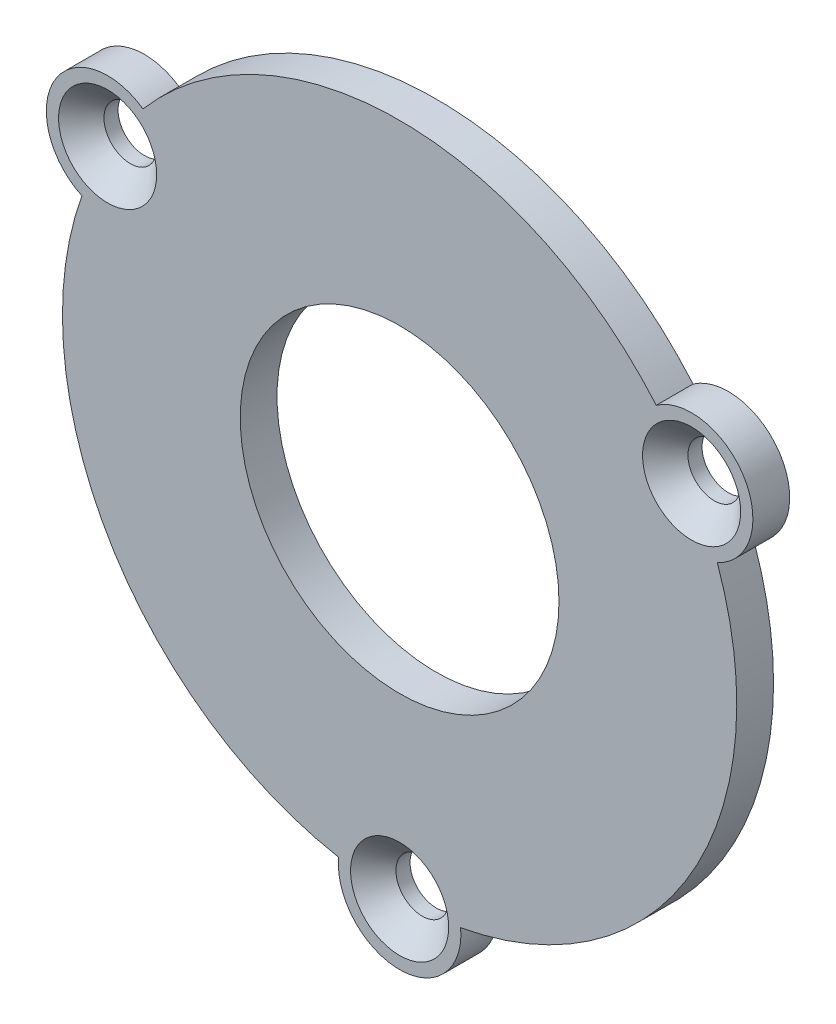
ISO-10303-21;
HEADER;
FILE_DESCRIPTION(('STEP AP214'),'2;1');
FILE_NAME('part.step','',(''),(''),'','','');
FILE_SCHEMA(('AUTOMOTIVE_DESIGN { 1 0 10303 214 1 1 1 1 }'));
ENDSEC;
DATA;
#1=APPLICATION_CONTEXT('core data for automotive mechanical design processes');
#2=APPLICATION_PROTOCOL_DEFINITION('international standard','automotive_design',2000,#1);
#3=PRODUCT_CONTEXT('',#1,'mechanical');
#4=PRODUCT('Part','Part','',(#3));
#5=PRODUCT_RELATED_PRODUCT_CATEGORY('part','',(#4));
#6=PRODUCT_DEFINITION_FORMATION('','',#4);
#7=PRODUCT_DEFINITION_CONTEXT('part definition',#1,'design');
#8=PRODUCT_DEFINITION('design','',#6,#7);
#9=PRODUCT_DEFINITION_SHAPE('','',#8);
#10=(LENGTH_UNIT() NAMED_UNIT(*) SI_UNIT(.MILLI.,.METRE.));
#11=(NAMED_UNIT(*) PLANE_ANGLE_UNIT() SI_UNIT($,.RADIAN.));
#12=(NAMED_UNIT(*) SI_UNIT($,.STERADIAN.) SOLID_ANGLE_UNIT());
#13=UNCERTAINTY_MEASURE_WITH_UNIT(LENGTH_MEASURE(1.E-05),#10,'distance_accuracy_value','');
#14=(GEOMETRIC_REPRESENTATION_CONTEXT(3) GLOBAL_UNCERTAINTY_ASSIGNED_CONTEXT((#13)) GLOBAL_UNIT_ASSIGNED_CONTEXT((#10,
#11,#12)) REPRESENTATION_CONTEXT('',''));
#15=CARTESIAN_POINT('',(0.,0.,0.));
#16=DIRECTION('',(0.,0.,1.));
#17=DIRECTION('',(1.,0.,0.));
#18=AXIS2_PLACEMENT_3D('',#15,#16,#17);
#19=CARTESIAN_POINT('',(0.,0.,3.));
#20=DIRECTION('',(0.,0.,-1.));
#21=DIRECTION('',(-1.,0.,0.));
#22=AXIS2_PLACEMENT_3D('',#19,#20,#21);
#23=CYLINDRICAL_SURFACE('',#22,27.5);
#24=DIRECTION('',(0.,0.,-1.));
#25=VECTOR('',#24,1.);
#26=CARTESIAN_POINT('',(25.9116986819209,9.21053046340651,1.5));
#27=LINE('',#26,#25);
#28=CARTESIAN_POINT('',(25.9116986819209,9.21053046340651,3.));
#29=VERTEX_POINT('',#28);
#30=CARTESIAN_POINT('',(25.9116986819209,9.21053046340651,0.));
#31=VERTEX_POINT('',#30);
#32=EDGE_CURVE('E88',#29,#31,#27,.T.);
#33=ORIENTED_EDGE('',*,*,#32,.F.);
#34=CARTESIAN_POINT('',(0.,0.,3.));
#35=DIRECTION('',(0.,0.,1.));
#36=DIRECTION('',(1.,0.,0.));
#37=AXIS2_PLACEMENT_3D('',#34,#35,#36);
#38=CIRCLE('',#37,27.5);
#39=CARTESIAN_POINT('',(4.97929597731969,-27.0454545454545,3.));
#40=VERTEX_POINT('',#39);
#41=EDGE_CURVE('E113',#40,#29,#38,.T.);
#42=ORIENTED_EDGE('',*,*,#41,.F.);
#43=DIRECTION('',(0.,0.,-1.));
#44=VECTOR('',#43,1.);
#45=CARTESIAN_POINT('',(4.97929597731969,-27.0454545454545,1.5));
#46=LINE('',#45,#44);
#47=CARTESIAN_POINT('',(4.97929597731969,-27.0454545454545,0.));
#48=VERTEX_POINT('',#47);
#49=EDGE_CURVE('E39',#48,#40,#46,.F.);
#50=ORIENTED_EDGE('',*,*,#49,.F.);
#51=CARTESIAN_POINT('',(0.,0.,0.));
#52=DIRECTION('',(0.,0.,1.));
#53=DIRECTION('',(1.,0.,0.));
#54=AXIS2_PLACEMENT_3D('',#51,#52,#53);
#55=CIRCLE('',#54,27.5);
#56=EDGE_CURVE('E107',#48,#31,#55,.T.);
#57=ORIENTED_EDGE('',*,*,#56,.T.);
#58=EDGE_LOOP('',(#33,#42,#50,#57));
#59=FACE_BOUND('',#58,.T.);
#60=ADVANCED_FACE('F32',(#59),#23,.T.);
#61=DIRECTION('',(0.,0.,-1.));
#62=VECTOR('',#61,1.);
#63=CARTESIAN_POINT('',(20.9324027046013,17.8349240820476,1.5));
#64=LINE('',#63,#62);
#65=CARTESIAN_POINT('',(20.9324027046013,17.8349240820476,0.));
#66=VERTEX_POINT('',#65);
#67=CARTESIAN_POINT('',(20.9324027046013,17.8349240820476,3.));
#68=VERTEX_POINT('',#67);
#69=EDGE_CURVE('E85',#66,#68,#64,.F.);
#70=ORIENTED_EDGE('',*,*,#69,.F.);
#71=CARTESIAN_POINT('',(-20.932402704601,17.8349240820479,0.));
#72=VERTEX_POINT('',#71);
#73=EDGE_CURVE('E98',#66,#72,#55,.T.);
#74=ORIENTED_EDGE('',*,*,#73,.T.);
#75=DIRECTION('',(0.,0.,-1.));
#76=VECTOR('',#75,1.);
#77=CARTESIAN_POINT('',(-20.932402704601,17.8349240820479,1.5));
#78=LINE('',#77,#76);
#79=CARTESIAN_POINT('',(-20.932402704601,17.8349240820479,3.));
#80=VERTEX_POINT('',#79);
#81=EDGE_CURVE('E195',#80,#72,#78,.T.);
#82=ORIENTED_EDGE('',*,*,#81,.F.);
#83=EDGE_CURVE('E100',#68,#80,#38,.T.);
#84=ORIENTED_EDGE('',*,*,#83,.F.);
#85=EDGE_LOOP('',(#70,#74,#82,#84));
#86=FACE_BOUND('',#85,.T.);
#87=ADVANCED_FACE('F96',(#86),#23,.T.);
#88=DIRECTION('',(0.,0.,-1.));
#89=VECTOR('',#88,1.);
#90=CARTESIAN_POINT('',(-25.9116986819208,9.21053046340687,1.5));
#91=LINE('',#90,#89);
#92=CARTESIAN_POINT('',(-25.9116986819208,9.21053046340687,0.));
#93=VERTEX_POINT('',#92);
#94=CARTESIAN_POINT('',(-25.9116986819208,9.21053046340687,3.));
#95=VERTEX_POINT('',#94);
#96=EDGE_CURVE('E133',#93,#95,#91,.F.);
#97=ORIENTED_EDGE('',*,*,#96,.F.);
#98=CARTESIAN_POINT('',(-4.97929597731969,-27.0454545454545,0.));
#99=VERTEX_POINT('',#98);
#100=EDGE_CURVE('E108',#93,#99,#55,.T.);
#101=ORIENTED_EDGE('',*,*,#100,.T.);
#102=DIRECTION('',(0.,0.,-1.));
#103=VECTOR('',#102,1.);
#104=CARTESIAN_POINT('',(-4.97929597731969,-27.0454545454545,1.5));
#105=LINE('',#104,#103);
#106=CARTESIAN_POINT('',(-4.97929597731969,-27.0454545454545,3.));
#107=VERTEX_POINT('',#106);
#108=EDGE_CURVE('E11',#107,#99,#105,.T.);
#109=ORIENTED_EDGE('',*,*,#108,.F.);
#110=EDGE_CURVE('E110',#95,#107,#38,.T.);
#111=ORIENTED_EDGE('',*,*,#110,.F.);
#112=EDGE_LOOP('',(#97,#101,#109,#111));
#113=FACE_BOUND('',#112,.T.);
#114=ADVANCED_FACE('F132',(#113),#23,.T.);
#115=CARTESIAN_POINT('',(0.,0.,3.));
#116=DIRECTION('',(0.,0.,1.));
#117=DIRECTION('',(1.,0.,0.));
#118=AXIS2_PLACEMENT_3D('',#115,#116,#117);
#119=PLANE('',#118);
#120=CARTESIAN_POINT('',(23.8156986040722,13.7499999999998,3.));
#121=DIRECTION('',(0.,0.,1.));
#122=DIRECTION('',(1.,0.,0.));
#123=AXIS2_PLACEMENT_3D('',#120,#121,#122);
#124=CIRCLE('',#123,4.);
#125=CARTESIAN_POINT('',(27.8156986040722,13.7499999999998,3.));
#126=VERTEX_POINT('',#125);
#127=EDGE_CURVE('E173',#126,#126,#124,.T.);
#128=ORIENTED_EDGE('',*,*,#127,.F.);
#129=EDGE_LOOP('',(#128));
#130=FACE_BOUND('',#129,.T.);
#131=CARTESIAN_POINT('',(-23.815698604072,13.7500000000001,3.));
#132=DIRECTION('',(0.,0.,1.));
#133=DIRECTION('',(1.,0.,0.));
#134=AXIS2_PLACEMENT_3D('',#131,#132,#133);
#135=CIRCLE('',#134,4.);
#136=CARTESIAN_POINT('',(-19.815698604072,13.7500000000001,3.));
#137=VERTEX_POINT('',#136);
#138=EDGE_CURVE('E176',#137,#137,#135,.T.);
#139=ORIENTED_EDGE('',*,*,#138,.F.);
#140=EDGE_LOOP('',(#139));
#141=FACE_BOUND('',#140,.T.);
#142=ORIENTED_EDGE('',*,*,#41,.T.);
#143=CARTESIAN_POINT('',(23.8156986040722,13.7499999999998,3.));
#144=DIRECTION('',(0.,0.,1.));
#145=DIRECTION('',(1.,0.,0.));
#146=AXIS2_PLACEMENT_3D('',#143,#144,#145);
#147=CIRCLE('',#146,5.);
#148=EDGE_CURVE('E46',#29,#68,#147,.T.);
#149=ORIENTED_EDGE('',*,*,#148,.T.);
#150=ORIENTED_EDGE('',*,*,#83,.T.);
#151=CARTESIAN_POINT('',(-23.815698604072,13.7500000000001,3.));
#152=DIRECTION('',(0.,0.,1.));
#153=DIRECTION('',(1.,0.,0.));
#154=AXIS2_PLACEMENT_3D('',#151,#152,#153);
#155=CIRCLE('',#154,5.);
#156=EDGE_CURVE('E52',#80,#95,#155,.T.);
#157=ORIENTED_EDGE('',*,*,#156,.T.);
#158=ORIENTED_EDGE('',*,*,#110,.T.);
#159=CARTESIAN_POINT('',(0.,-27.5,3.));
#160=DIRECTION('',(0.,0.,1.));
#161=DIRECTION('',(1.,0.,0.));
#162=AXIS2_PLACEMENT_3D('',#159,#160,#161);
#163=CIRCLE('',#162,5.);
#164=EDGE_CURVE('E123',#107,#40,#163,.T.);
#165=ORIENTED_EDGE('',*,*,#164,.T.);
#166=EDGE_LOOP('',(#142,#149,#150,#157,#158,#165));
#167=FACE_BOUND('',#166,.T.);
#168=CARTESIAN_POINT('',(0.,-27.5,3.));
#169=DIRECTION('',(0.,0.,1.));
#170=DIRECTION('',(1.,0.,0.));
#171=AXIS2_PLACEMENT_3D('',#168,#169,#170);
#172=CIRCLE('',#171,4.);
#173=CARTESIAN_POINT('',(4.,-27.5,3.));
#174=VERTEX_POINT('',#173);
#175=EDGE_CURVE('E197',#174,#174,#172,.T.);
#176=ORIENTED_EDGE('',*,*,#175,.F.);
#177=EDGE_LOOP('',(#176));
#178=FACE_BOUND('',#177,.T.);
#179=CARTESIAN_POINT('',(0.,0.,3.));
#180=DIRECTION('',(0.,0.,1.));
#181=DIRECTION('',(1.,0.,0.));
#182=AXIS2_PLACEMENT_3D('',#179,#180,#181);
#183=CIRCLE('',#182,13.);
#184=CARTESIAN_POINT('',(13.,0.,3.));
#185=VERTEX_POINT('',#184);
#186=EDGE_CURVE('E111',#185,#185,#183,.T.);
#187=ORIENTED_EDGE('',*,*,#186,.F.);
#188=EDGE_LOOP('',(#187));
#189=FACE_BOUND('',#188,.T.);
#190=ADVANCED_FACE('F121',(#130,#141,#167,#178,#189),#119,.T.);
#191=CARTESIAN_POINT('',(0.,0.,0.));
#192=DIRECTION('',(0.,0.,1.));
#193=DIRECTION('',(1.,0.,0.));
#194=AXIS2_PLACEMENT_3D('',#191,#192,#193);
#195=PLANE('',#194);
#196=CARTESIAN_POINT('',(23.8156986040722,13.7499999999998,0.));
#197=DIRECTION('',(0.,0.,1.));
#198=DIRECTION('',(1.,0.,0.));
#199=AXIS2_PLACEMENT_3D('',#196,#197,#198);
#200=CIRCLE('',#199,2.15);
#201=CARTESIAN_POINT('',(25.9656986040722,13.7499999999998,0.));
#202=VERTEX_POINT('',#201);
#203=EDGE_CURVE('E179',#202,#202,#200,.T.);
#204=ORIENTED_EDGE('',*,*,#203,.T.);
#205=EDGE_LOOP('',(#204));
#206=FACE_BOUND('',#205,.T.);
#207=CARTESIAN_POINT('',(-23.815698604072,13.7500000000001,0.));
#208=DIRECTION('',(0.,0.,1.));
#209=DIRECTION('',(1.,0.,0.));
#210=AXIS2_PLACEMENT_3D('',#207,#208,#209);
#211=CIRCLE('',#210,2.15);
#212=CARTESIAN_POINT('',(-21.665698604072,13.7500000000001,0.));
#213=VERTEX_POINT('',#212);
#214=EDGE_CURVE('E93',#213,#213,#211,.T.);
#215=ORIENTED_EDGE('',*,*,#214,.T.);
#216=EDGE_LOOP('',(#215));
#217=FACE_BOUND('',#216,.T.);
#218=ORIENTED_EDGE('',*,*,#73,.F.);
#219=CARTESIAN_POINT('',(23.8156986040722,13.7499999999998,0.));
#220=DIRECTION('',(0.,0.,1.));
#221=DIRECTION('',(-0.499999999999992,0.866025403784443,0.));
#222=AXIS2_PLACEMENT_3D('',#219,#220,#221);
#223=CIRCLE('',#222,5.);
#224=EDGE_CURVE('E82',#31,#66,#223,.T.);
#225=ORIENTED_EDGE('',*,*,#224,.F.);
#226=ORIENTED_EDGE('',*,*,#56,.F.);
#227=CARTESIAN_POINT('',(0.,-27.5,0.));
#228=DIRECTION('',(0.,0.,1.));
#229=DIRECTION('',(1.,0.,0.));
#230=AXIS2_PLACEMENT_3D('',#227,#228,#229);
#231=CIRCLE('',#230,5.);
#232=EDGE_CURVE('E130',#99,#48,#231,.T.);
#233=ORIENTED_EDGE('',*,*,#232,.F.);
#234=ORIENTED_EDGE('',*,*,#100,.F.);
#235=CARTESIAN_POINT('',(-23.815698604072,13.7500000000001,0.));
#236=DIRECTION('',(0.,0.,1.));
#237=DIRECTION('',(-0.500000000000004,-0.866025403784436,0.));
#238=AXIS2_PLACEMENT_3D('',#235,#236,#237);
#239=CIRCLE('',#238,5.);
#240=EDGE_CURVE('E106',#72,#93,#239,.T.);
#241=ORIENTED_EDGE('',*,*,#240,.F.);
#242=EDGE_LOOP('',(#218,#225,#226,#233,#234,#241));
#243=FACE_BOUND('',#242,.T.);
#244=CARTESIAN_POINT('',(0.,-27.5,0.));
#245=DIRECTION('',(0.,0.,1.));
#246=DIRECTION('',(1.,0.,0.));
#247=AXIS2_PLACEMENT_3D('',#244,#245,#246);
#248=CIRCLE('',#247,2.15);
#249=CARTESIAN_POINT('',(2.15,-27.5,0.));
#250=VERTEX_POINT('',#249);
#251=EDGE_CURVE('E134',#250,#250,#248,.T.);
#252=ORIENTED_EDGE('',*,*,#251,.T.);
#253=EDGE_LOOP('',(#252));
#254=FACE_BOUND('',#253,.T.);
#255=CARTESIAN_POINT('',(0.,0.,0.));
#256=DIRECTION('',(0.,0.,1.));
#257=DIRECTION('',(1.,0.,0.));
#258=AXIS2_PLACEMENT_3D('',#255,#256,#257);
#259=CIRCLE('',#258,13.);
#260=CARTESIAN_POINT('',(13.,0.,0.));
#261=VERTEX_POINT('',#260);
#262=EDGE_CURVE('E129',#261,#261,#259,.T.);
#263=ORIENTED_EDGE('',*,*,#262,.T.);
#264=EDGE_LOOP('',(#263));
#265=FACE_BOUND('',#264,.T.);
#266=ADVANCED_FACE('F103',(#206,#217,#243,#254,#265),#195,.F.);
#267=CARTESIAN_POINT('',(0.,0.,3.));
#268=DIRECTION('',(0.,0.,-1.));
#269=DIRECTION('',(-1.,0.,0.));
#270=AXIS2_PLACEMENT_3D('',#267,#268,#269);
#271=CYLINDRICAL_SURFACE('',#270,13.);
#272=ORIENTED_EDGE('',*,*,#186,.T.);
#273=EDGE_LOOP('',(#272));
#274=FACE_BOUND('',#273,.T.);
#275=ORIENTED_EDGE('',*,*,#262,.F.);
#276=EDGE_LOOP('',(#275));
#277=FACE_BOUND('',#276,.T.);
#278=ADVANCED_FACE('F146',(#274,#277),#271,.F.);
#279=CARTESIAN_POINT('',(0.,-27.5,17.142135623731));
#280=DIRECTION('',(0.,0.,-1.));
#281=DIRECTION('',(-1.,0.,0.));
#282=AXIS2_PLACEMENT_3D('',#279,#280,#281);
#283=CYLINDRICAL_SURFACE('',#282,5.);
#284=ORIENTED_EDGE('',*,*,#164,.F.);
#285=ORIENTED_EDGE('',*,*,#108,.T.);
#286=ORIENTED_EDGE('',*,*,#232,.T.);
#287=ORIENTED_EDGE('',*,*,#49,.T.);
#288=EDGE_LOOP('',(#284,#285,#286,#287));
#289=FACE_BOUND('',#288,.T.);
#290=ADVANCED_FACE('F127',(#289),#283,.T.);
#291=CARTESIAN_POINT('',(0.,-27.5,3.));
#292=DIRECTION('',(0.,0.,1.));
#293=DIRECTION('',(1.,0.,0.));
#294=AXIS2_PLACEMENT_3D('',#291,#292,#293);
#295=CYLINDRICAL_SURFACE('',#294,2.14999999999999);
#296=ORIENTED_EDGE('',*,*,#251,.F.);
#297=EDGE_LOOP('',(#296));
#298=FACE_BOUND('',#297,.T.);
#299=CARTESIAN_POINT('',(0.,-27.5,1.14999999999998));
#300=DIRECTION('',(0.,0.,1.));
#301=DIRECTION('',(1.,0.,0.));
#302=AXIS2_PLACEMENT_3D('',#299,#300,#301);
#303=CIRCLE('',#302,2.14999999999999);
#304=CARTESIAN_POINT('',(2.14999999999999,-27.5,1.14999999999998));
#305=VERTEX_POINT('',#304);
#306=EDGE_CURVE('E137',#305,#305,#303,.T.);
#307=ORIENTED_EDGE('',*,*,#306,.T.);
#308=EDGE_LOOP('',(#307));
#309=FACE_BOUND('',#308,.T.);
#310=ADVANCED_FACE('F154',(#298,#309),#295,.F.);
#311=CARTESIAN_POINT('',(0.,-27.5,3.));
#312=DIRECTION('',(0.,0.,1.));
#313=DIRECTION('',(1.,0.,0.));
#314=AXIS2_PLACEMENT_3D('',#311,#312,#313);
#315=CONICAL_SURFACE('',#314,4.,0.785398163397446);
#316=ORIENTED_EDGE('',*,*,#306,.F.);
#317=EDGE_LOOP('',(#316));
#318=FACE_BOUND('',#317,.T.);
#319=ORIENTED_EDGE('',*,*,#175,.T.);
#320=EDGE_LOOP('',(#319));
#321=FACE_BOUND('',#320,.T.);
#322=ADVANCED_FACE('F203',(#318,#321),#315,.F.);
#323=CARTESIAN_POINT('',(-23.815698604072,13.7500000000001,17.142135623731));
#324=DIRECTION('',(0.,0.,-1.));
#325=DIRECTION('',(-1.,0.,0.));
#326=AXIS2_PLACEMENT_3D('',#323,#324,#325);
#327=CYLINDRICAL_SURFACE('',#326,5.);
#328=ORIENTED_EDGE('',*,*,#156,.F.);
#329=ORIENTED_EDGE('',*,*,#81,.T.);
#330=ORIENTED_EDGE('',*,*,#240,.T.);
#331=ORIENTED_EDGE('',*,*,#96,.T.);
#332=EDGE_LOOP('',(#328,#329,#330,#331));
#333=FACE_BOUND('',#332,.T.);
#334=ADVANCED_FACE('F206',(#333),#327,.T.);
#335=CARTESIAN_POINT('',(23.8156986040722,13.7499999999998,17.142135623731));
#336=DIRECTION('',(0.,0.,-1.));
#337=DIRECTION('',(-1.,0.,0.));
#338=AXIS2_PLACEMENT_3D('',#335,#336,#337);
#339=CYLINDRICAL_SURFACE('',#338,5.);
#340=ORIENTED_EDGE('',*,*,#148,.F.);
#341=ORIENTED_EDGE('',*,*,#32,.T.);
#342=ORIENTED_EDGE('',*,*,#224,.T.);
#343=ORIENTED_EDGE('',*,*,#69,.T.);
#344=EDGE_LOOP('',(#340,#341,#342,#343));
#345=FACE_BOUND('',#344,.T.);
#346=ADVANCED_FACE('F84',(#345),#339,.T.);
#347=CARTESIAN_POINT('',(-23.815698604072,13.7500000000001,3.));
#348=DIRECTION('',(0.,0.,1.));
#349=DIRECTION('',(1.,0.,0.));
#350=AXIS2_PLACEMENT_3D('',#347,#348,#349);
#351=CYLINDRICAL_SURFACE('',#350,2.14999999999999);
#352=ORIENTED_EDGE('',*,*,#214,.F.);
#353=EDGE_LOOP('',(#352));
#354=FACE_BOUND('',#353,.T.);
#355=CARTESIAN_POINT('',(-23.815698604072,13.7500000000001,1.14999999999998));
#356=DIRECTION('',(0.,0.,1.));
#357=DIRECTION('',(1.,0.,0.));
#358=AXIS2_PLACEMENT_3D('',#355,#356,#357);
#359=CIRCLE('',#358,2.14999999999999);
#360=CARTESIAN_POINT('',(-21.665698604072,13.7500000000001,1.14999999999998));
#361=VERTEX_POINT('',#360);
#362=EDGE_CURVE('E178',#361,#361,#359,.T.);
#363=ORIENTED_EDGE('',*,*,#362,.T.);
#364=EDGE_LOOP('',(#363));
#365=FACE_BOUND('',#364,.T.);
#366=ADVANCED_FACE('F222',(#354,#365),#351,.F.);
#367=CARTESIAN_POINT('',(-23.815698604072,13.7500000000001,3.));
#368=DIRECTION('',(0.,0.,1.));
#369=DIRECTION('',(1.,0.,0.));
#370=AXIS2_PLACEMENT_3D('',#367,#368,#369);
#371=CONICAL_SURFACE('',#370,4.,0.785398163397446);
#372=ORIENTED_EDGE('',*,*,#362,.F.);
#373=EDGE_LOOP('',(#372));
#374=FACE_BOUND('',#373,.T.);
#375=ORIENTED_EDGE('',*,*,#138,.T.);
#376=EDGE_LOOP('',(#375));
#377=FACE_BOUND('',#376,.T.);
#378=ADVANCED_FACE('F225',(#374,#377),#371,.F.);
#379=CARTESIAN_POINT('',(23.8156986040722,13.7499999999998,3.));
#380=DIRECTION('',(0.,0.,1.));
#381=DIRECTION('',(1.,0.,0.));
#382=AXIS2_PLACEMENT_3D('',#379,#380,#381);
#383=CYLINDRICAL_SURFACE('',#382,2.14999999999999);
#384=ORIENTED_EDGE('',*,*,#203,.F.);
#385=EDGE_LOOP('',(#384));
#386=FACE_BOUND('',#385,.T.);
#387=CARTESIAN_POINT('',(23.8156986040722,13.7499999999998,1.14999999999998));
#388=DIRECTION('',(0.,0.,1.));
#389=DIRECTION('',(1.,0.,0.));
#390=AXIS2_PLACEMENT_3D('',#387,#388,#389);
#391=CIRCLE('',#390,2.14999999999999);
#392=CARTESIAN_POINT('',(25.9656986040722,13.7499999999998,1.14999999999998));
#393=VERTEX_POINT('',#392);
#394=EDGE_CURVE('E184',#393,#393,#391,.T.);
#395=ORIENTED_EDGE('',*,*,#394,.T.);
#396=EDGE_LOOP('',(#395));
#397=FACE_BOUND('',#396,.T.);
#398=ADVANCED_FACE('F229',(#386,#397),#383,.F.);
#399=CARTESIAN_POINT('',(23.8156986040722,13.7499999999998,3.));
#400=DIRECTION('',(0.,0.,1.));
#401=DIRECTION('',(1.,0.,0.));
#402=AXIS2_PLACEMENT_3D('',#399,#400,#401);
#403=CONICAL_SURFACE('',#402,4.,0.785398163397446);
#404=ORIENTED_EDGE('',*,*,#394,.F.);
#405=EDGE_LOOP('',(#404));
#406=FACE_BOUND('',#405,.T.);
#407=ORIENTED_EDGE('',*,*,#127,.T.);
#408=EDGE_LOOP('',(#407));
#409=FACE_BOUND('',#408,.T.);
#410=ADVANCED_FACE('F233',(#406,#409),#403,.F.);
#411=CLOSED_SHELL('',(#60,#87,#114,#190,#266,#278,#290,#310,#322,#334,#346,#366,#378,#398,#410));
#412=MANIFOLD_SOLID_BREP('B2',#411);
#413=ADVANCED_BREP_SHAPE_REPRESENTATION('',(#18,#412),#14);
#414=SHAPE_DEFINITION_REPRESENTATION(#9,#413);
ENDSEC;
END-ISO-10303-21;
